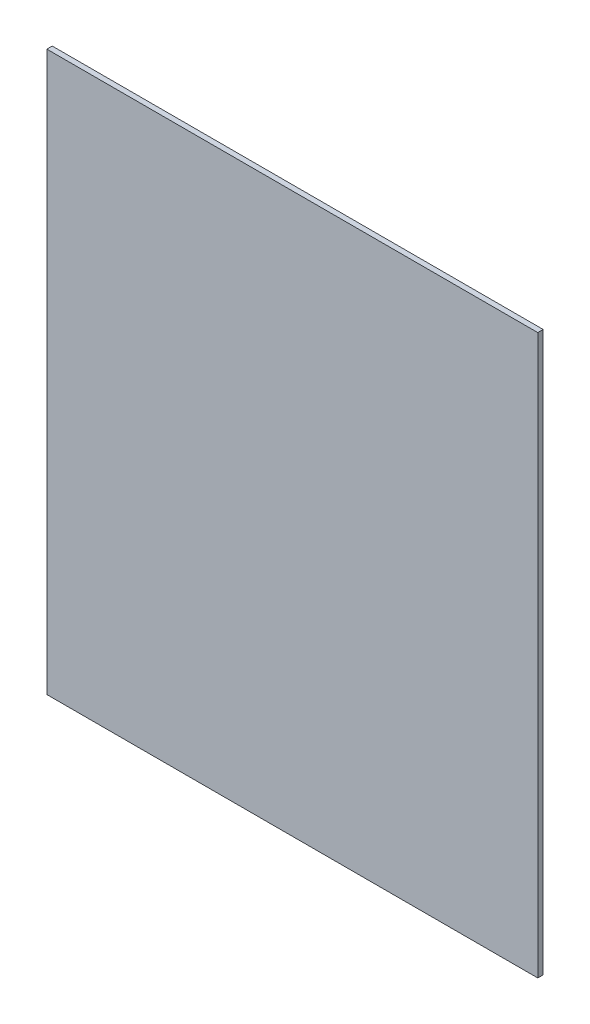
ISO-10303-21;
HEADER;
FILE_DESCRIPTION(('STEP AP214'),'2;1');
FILE_NAME('part.step','',(''),(''),'','','');
FILE_SCHEMA(('AUTOMOTIVE_DESIGN { 1 0 10303 214 1 1 1 1 }'));
ENDSEC;
DATA;
#1=APPLICATION_CONTEXT('core data for automotive mechanical design processes');
#2=APPLICATION_PROTOCOL_DEFINITION('international standard','automotive_design',2000,#1);
#3=PRODUCT_CONTEXT('',#1,'mechanical');
#4=PRODUCT('Part','Part','',(#3));
#5=PRODUCT_RELATED_PRODUCT_CATEGORY('part','',(#4));
#6=PRODUCT_DEFINITION_FORMATION('','',#4);
#7=PRODUCT_DEFINITION_CONTEXT('part definition',#1,'design');
#8=PRODUCT_DEFINITION('design','',#6,#7);
#9=PRODUCT_DEFINITION_SHAPE('','',#8);
#10=(LENGTH_UNIT() NAMED_UNIT(*) SI_UNIT(.MILLI.,.METRE.));
#11=(NAMED_UNIT(*) PLANE_ANGLE_UNIT() SI_UNIT($,.RADIAN.));
#12=(NAMED_UNIT(*) SI_UNIT($,.STERADIAN.) SOLID_ANGLE_UNIT());
#13=UNCERTAINTY_MEASURE_WITH_UNIT(LENGTH_MEASURE(1.E-05),#10,'distance_accuracy_value','');
#14=(GEOMETRIC_REPRESENTATION_CONTEXT(3) GLOBAL_UNCERTAINTY_ASSIGNED_CONTEXT((#13)) GLOBAL_UNIT_ASSIGNED_CONTEXT((#10,
#11,#12)) REPRESENTATION_CONTEXT('',''));
#15=CARTESIAN_POINT('',(0.,0.,0.));
#16=DIRECTION('',(0.,0.,1.));
#17=DIRECTION('',(1.,0.,0.));
#18=AXIS2_PLACEMENT_3D('',#15,#16,#17);
#19=CARTESIAN_POINT('',(6.82300000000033,-7.76799999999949,0.149999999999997));
#20=DIRECTION('',(0.,-0.999999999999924,0.));
#21=DIRECTION('',(0.,0.,-0.999999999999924));
#22=AXIS2_PLACEMENT_3D('',#19,#20,#21);
#23=PLANE('',#22);
#24=DIRECTION('',(-1.,0.,0.));
#25=VECTOR('',#24,1.);
#26=CARTESIAN_POINT('',(6.82300000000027,-7.76799999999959,0.));
#27=LINE('',#26,#25);
#28=CARTESIAN_POINT('',(6.82300000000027,-7.76799999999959,0.));
#29=VERTEX_POINT('',#28);
#30=CARTESIAN_POINT('',(-6.82299999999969,-7.76799999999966,0.));
#31=VERTEX_POINT('',#30);
#32=EDGE_CURVE('E76',#29,#31,#27,.T.);
#33=ORIENTED_EDGE('',*,*,#32,.F.);
#34=DIRECTION('',(0.,0.,-0.999999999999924));
#35=VECTOR('',#34,1.);
#36=CARTESIAN_POINT('',(6.82300000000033,-7.76799999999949,0.149999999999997));
#37=LINE('',#36,#35);
#38=CARTESIAN_POINT('',(6.82300000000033,-7.76799999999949,0.149999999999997));
#39=VERTEX_POINT('',#38);
#40=EDGE_CURVE('E11',#39,#29,#37,.T.);
#41=ORIENTED_EDGE('',*,*,#40,.F.);
#42=DIRECTION('',(-1.,0.,0.));
#43=VECTOR('',#42,1.);
#44=CARTESIAN_POINT('',(6.82300000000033,-7.76799999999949,0.149999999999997));
#45=LINE('',#44,#43);
#46=CARTESIAN_POINT('',(-6.82299999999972,-7.76799999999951,0.150000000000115));
#47=VERTEX_POINT('',#46);
#48=EDGE_CURVE('E78',#39,#47,#45,.T.);
#49=ORIENTED_EDGE('',*,*,#48,.T.);
#50=DIRECTION('',(0.,0.,-0.999999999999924));
#51=VECTOR('',#50,1.);
#52=CARTESIAN_POINT('',(-6.82299999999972,-7.76799999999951,0.150000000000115));
#53=LINE('',#52,#51);
#54=EDGE_CURVE('E39',#47,#31,#53,.T.);
#55=ORIENTED_EDGE('',*,*,#54,.T.);
#56=EDGE_LOOP('',(#33,#41,#49,#55));
#57=FACE_BOUND('',#56,.T.);
#58=ADVANCED_FACE('F36',(#57),#23,.T.);
#59=CARTESIAN_POINT('',(6.82299999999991,7.76799999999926,0.149999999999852));
#60=DIRECTION('',(1.,0.,0.));
#61=DIRECTION('',(0.,0.999999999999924,0.));
#62=AXIS2_PLACEMENT_3D('',#59,#60,#61);
#63=PLANE('',#62);
#64=DIRECTION('',(0.,-0.999999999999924,0.));
#65=VECTOR('',#64,1.);
#66=CARTESIAN_POINT('',(6.82299999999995,7.76799999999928,-1.2490009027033E-13));
#67=LINE('',#66,#65);
#68=CARTESIAN_POINT('',(6.82299999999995,7.76799999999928,-1.2490009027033E-13));
#69=VERTEX_POINT('',#68);
#70=EDGE_CURVE('E93',#69,#29,#67,.T.);
#71=ORIENTED_EDGE('',*,*,#70,.F.);
#72=DIRECTION('',(0.,0.,-0.999999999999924));
#73=VECTOR('',#72,1.);
#74=CARTESIAN_POINT('',(6.82299999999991,7.76799999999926,0.149999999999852));
#75=LINE('',#74,#73);
#76=CARTESIAN_POINT('',(6.82299999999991,7.76799999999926,0.149999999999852));
#77=VERTEX_POINT('',#76);
#78=EDGE_CURVE('E44',#77,#69,#75,.T.);
#79=ORIENTED_EDGE('',*,*,#78,.F.);
#80=DIRECTION('',(0.,-0.999999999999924,0.));
#81=VECTOR('',#80,1.);
#82=CARTESIAN_POINT('',(6.82299999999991,7.76799999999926,0.149999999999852));
#83=LINE('',#82,#81);
#84=EDGE_CURVE('E83',#77,#39,#83,.T.);
#85=ORIENTED_EDGE('',*,*,#84,.T.);
#86=ORIENTED_EDGE('',*,*,#40,.T.);
#87=EDGE_LOOP('',(#71,#79,#85,#86));
#88=FACE_BOUND('',#87,.T.);
#89=ADVANCED_FACE('F108',(#88),#63,.T.);
#90=CARTESIAN_POINT('',(-6.82300000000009,7.76799999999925,0.149999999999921));
#91=DIRECTION('',(0.,0.999999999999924,0.));
#92=DIRECTION('',(-1.,0.,0.));
#93=AXIS2_PLACEMENT_3D('',#90,#91,#92);
#94=PLANE('',#93);
#95=DIRECTION('',(1.,0.,0.));
#96=VECTOR('',#95,1.);
#97=CARTESIAN_POINT('',(-6.82300000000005,7.76799999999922,0.));
#98=LINE('',#97,#96);
#99=CARTESIAN_POINT('',(-6.82300000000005,7.76799999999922,0.));
#100=VERTEX_POINT('',#99);
#101=EDGE_CURVE('E90',#100,#69,#98,.T.);
#102=ORIENTED_EDGE('',*,*,#101,.F.);
#103=DIRECTION('',(0.,0.,-0.999999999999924));
#104=VECTOR('',#103,1.);
#105=CARTESIAN_POINT('',(-6.82300000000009,7.76799999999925,0.149999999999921));
#106=LINE('',#105,#104);
#107=CARTESIAN_POINT('',(-6.82300000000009,7.76799999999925,0.149999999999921));
#108=VERTEX_POINT('',#107);
#109=EDGE_CURVE('E82',#108,#100,#106,.T.);
#110=ORIENTED_EDGE('',*,*,#109,.F.);
#111=DIRECTION('',(1.,0.,0.));
#112=VECTOR('',#111,1.);
#113=CARTESIAN_POINT('',(-6.82300000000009,7.76799999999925,0.149999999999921));
#114=LINE('',#113,#112);
#115=EDGE_CURVE('E101',#108,#77,#114,.T.);
#116=ORIENTED_EDGE('',*,*,#115,.T.);
#117=ORIENTED_EDGE('',*,*,#78,.T.);
#118=EDGE_LOOP('',(#102,#110,#116,#117));
#119=FACE_BOUND('',#118,.T.);
#120=ADVANCED_FACE('F105',(#119),#94,.T.);
#121=CARTESIAN_POINT('',(-6.82299999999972,-7.76799999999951,0.150000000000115));
#122=DIRECTION('',(-1.,0.,0.));
#123=DIRECTION('',(0.,0.,0.999999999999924));
#124=AXIS2_PLACEMENT_3D('',#121,#122,#123);
#125=PLANE('',#124);
#126=DIRECTION('',(0.,0.999999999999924,0.));
#127=VECTOR('',#126,1.);
#128=CARTESIAN_POINT('',(-6.82299999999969,-7.76799999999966,0.));
#129=LINE('',#128,#127);
#130=EDGE_CURVE('E85',#31,#100,#129,.T.);
#131=ORIENTED_EDGE('',*,*,#130,.F.);
#132=ORIENTED_EDGE('',*,*,#54,.F.);
#133=DIRECTION('',(0.,0.999999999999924,0.));
#134=VECTOR('',#133,1.);
#135=CARTESIAN_POINT('',(-6.82299999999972,-7.76799999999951,0.150000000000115));
#136=LINE('',#135,#134);
#137=EDGE_CURVE('E99',#47,#108,#136,.T.);
#138=ORIENTED_EDGE('',*,*,#137,.T.);
#139=ORIENTED_EDGE('',*,*,#109,.T.);
#140=EDGE_LOOP('',(#131,#132,#138,#139));
#141=FACE_BOUND('',#140,.T.);
#142=ADVANCED_FACE('F86',(#141),#125,.T.);
#143=CARTESIAN_POINT('',(-6.82299999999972,-7.76799999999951,0.150000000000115));
#144=DIRECTION('',(0.,0.,-0.999999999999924));
#145=DIRECTION('',(-1.,0.,0.));
#146=AXIS2_PLACEMENT_3D('',#143,#144,#145);
#147=PLANE('',#146);
#148=ORIENTED_EDGE('',*,*,#48,.F.);
#149=ORIENTED_EDGE('',*,*,#84,.F.);
#150=ORIENTED_EDGE('',*,*,#115,.F.);
#151=ORIENTED_EDGE('',*,*,#137,.F.);
#152=EDGE_LOOP('',(#148,#149,#150,#151));
#153=FACE_BOUND('',#152,.T.);
#154=ADVANCED_FACE('F110',(#153),#147,.F.);
#155=CARTESIAN_POINT('',(-6.82299999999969,-7.76799999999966,0.));
#156=DIRECTION('',(0.,0.,-0.999999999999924));
#157=DIRECTION('',(-1.,0.,0.));
#158=AXIS2_PLACEMENT_3D('',#155,#156,#157);
#159=PLANE('',#158);
#160=ORIENTED_EDGE('',*,*,#32,.T.);
#161=ORIENTED_EDGE('',*,*,#130,.T.);
#162=ORIENTED_EDGE('',*,*,#101,.T.);
#163=ORIENTED_EDGE('',*,*,#70,.T.);
#164=EDGE_LOOP('',(#160,#161,#162,#163));
#165=FACE_BOUND('',#164,.T.);
#166=ADVANCED_FACE('F92',(#165),#159,.T.);
#167=CLOSED_SHELL('',(#58,#89,#120,#142,#154,#166));
#168=MANIFOLD_SOLID_BREP('B2',#167);
#169=ADVANCED_BREP_SHAPE_REPRESENTATION('',(#18,#168),#14);
#170=SHAPE_DEFINITION_REPRESENTATION(#9,#169);
ENDSEC;
END-ISO-10303-21;
